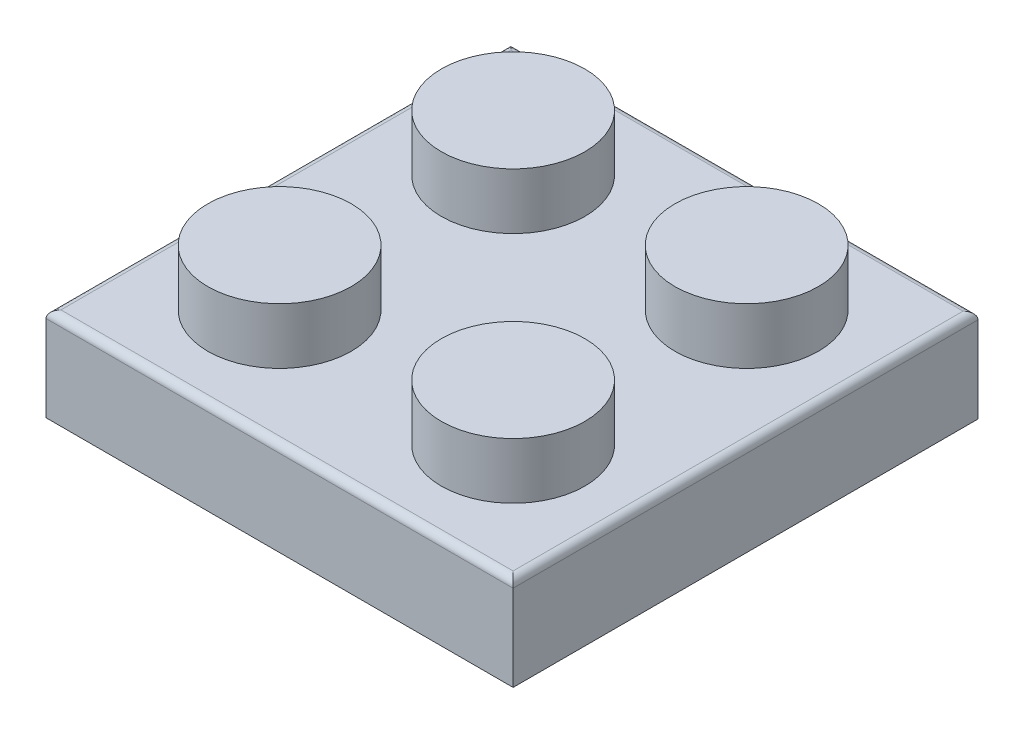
from build123d import *

# Parameters (mm, degrees)
SKETCH1_W            = 15.875
SKETCH1_H            = 15.8
BASE_EXTRUDE_DEPTH   = 3.175
SKETCH2_R            = 2.4384
BOSS_EXTRUDE1_DEPTH  = 1.905
LPATTERN4_COUNT      = 2
LPATTERN4_PITCH      = 7.9375
LPATTERN4_COUNT_DIR2 = 2
LPATTERN4_PITCH_DIR2 = 7.9375
SHELL1_T             = -1.5875
SKETCH3_R            = 3.2004
SKETCH3_R_2          = 2.4384
INSDOT_DEPTH         = 1.5875
FILLET1_R            = 0.254


with BuildPart() as part:
    # Sketch1 → Base-Extrude (new body)
    with BuildSketch(Plane(origin=(0, 0, 0), x_dir=(1, 0, 0), z_dir=(0, 1, 0))):
        Rectangle(SKETCH1_W, SKETCH1_H)
    extrude(amount=BASE_EXTRUDE_DEPTH)

    # Sketch2 → Boss-Extrude1 (add)
    with BuildSketch(Plane(origin=(0, 3.175, 0), x_dir=(-1, 0, 0), z_dir=(0, 1, 0))):
        with Locations(Location((3.96875, 3.93125, 0), (0, 0, 270))):
            Circle(SKETCH2_R)
    boss_extrude1 = extrude(amount=BOSS_EXTRUDE1_DEPTH)

    # LPattern4: Boss-Extrude1 2 × 2
    with Locations(*[(i * LPATTERN4_PITCH, 0, -j * LPATTERN4_PITCH_DIR2) for i in range(LPATTERN4_COUNT) for j in range(LPATTERN4_COUNT_DIR2) if (i, j) != (0, 0)]):
        add(boss_extrude1)

    # Shell1
    shell1_openings = [part.faces().sort_by_distance(p)[0] for p in [
        (0, 0, 0),
    ]]
    offset(amount=SHELL1_T, openings=shell1_openings, kind=Kind.INTERSECTION)

    # Sketch3 → InsDot (add)
    with BuildSketch(Plane.XZ.offset(-1.5875)):
        Circle(SKETCH3_R)
        Circle(SKETCH3_R_2, mode=Mode.SUBTRACT)
    extrude(amount=INSDOT_DEPTH)

    # Fillet1
    fillet1_edges = [part.edges().sort_by_distance(p)[0] for p in [
        (7.9375, 3.175, 0),
        (0, 3.175, -7.9),
        (-7.9375, 3.175, 0),
        (0, 3.175, 7.9),
    ]]
    fillet(fillet1_edges, radius=FILLET1_R)


solid = part.part
